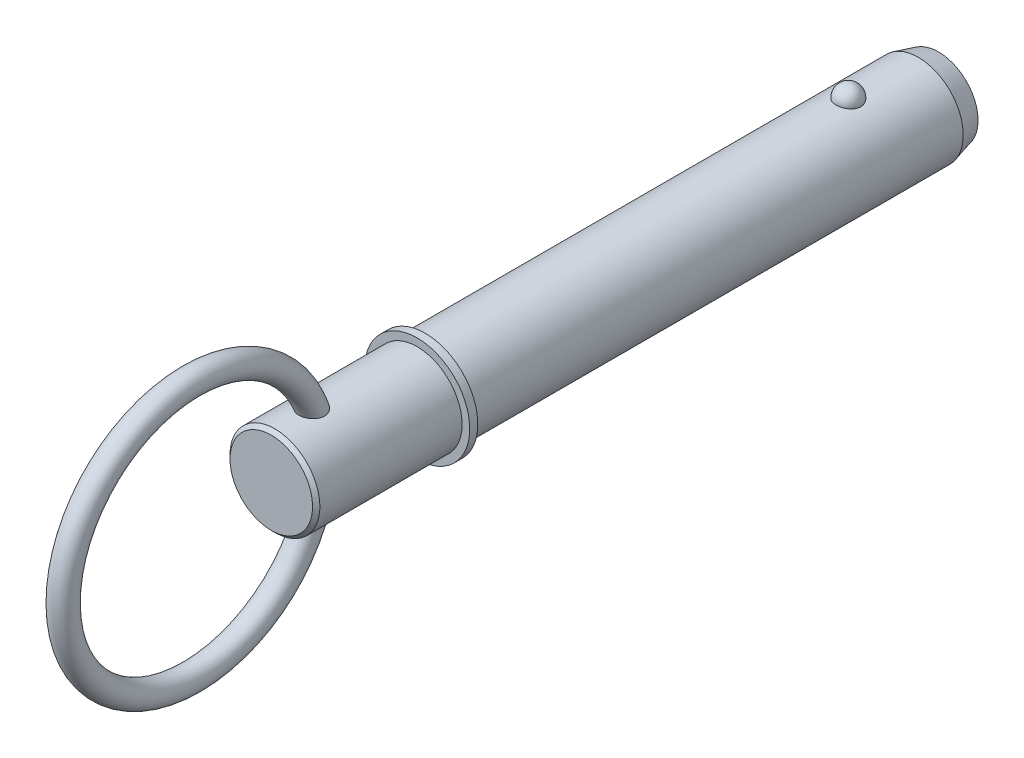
ISO-10303-21;
HEADER;
FILE_DESCRIPTION(('STEP AP214'),'2;1');
FILE_NAME('part.step','',(''),(''),'','','');
FILE_SCHEMA(('AUTOMOTIVE_DESIGN { 1 0 10303 214 1 1 1 1 }'));
ENDSEC;
DATA;
#1=APPLICATION_CONTEXT('core data for automotive mechanical design processes');
#2=APPLICATION_PROTOCOL_DEFINITION('international standard','automotive_design',2000,#1);
#3=PRODUCT_CONTEXT('',#1,'mechanical');
#4=PRODUCT('Part','Part','',(#3));
#5=PRODUCT_RELATED_PRODUCT_CATEGORY('part','',(#4));
#6=PRODUCT_DEFINITION_FORMATION('','',#4);
#7=PRODUCT_DEFINITION_CONTEXT('part definition',#1,'design');
#8=PRODUCT_DEFINITION('design','',#6,#7);
#9=PRODUCT_DEFINITION_SHAPE('','',#8);
#10=(LENGTH_UNIT() NAMED_UNIT(*) SI_UNIT(.MILLI.,.METRE.));
#11=(NAMED_UNIT(*) PLANE_ANGLE_UNIT() SI_UNIT($,.RADIAN.));
#12=(NAMED_UNIT(*) SI_UNIT($,.STERADIAN.) SOLID_ANGLE_UNIT());
#13=UNCERTAINTY_MEASURE_WITH_UNIT(LENGTH_MEASURE(1.E-05),#10,'distance_accuracy_value','');
#14=(GEOMETRIC_REPRESENTATION_CONTEXT(3) GLOBAL_UNCERTAINTY_ASSIGNED_CONTEXT((#13)) GLOBAL_UNIT_ASSIGNED_CONTEXT((#10,
#11,#12)) REPRESENTATION_CONTEXT('',''));
#15=CARTESIAN_POINT('',(0.,0.,0.));
#16=DIRECTION('',(0.,0.,1.));
#17=DIRECTION('',(1.,0.,0.));
#18=AXIS2_PLACEMENT_3D('',#15,#16,#17);
#19=CARTESIAN_POINT('',(0.,0.,101.6));
#20=DIRECTION('',(0.,0.,-1.));
#21=DIRECTION('',(-1.,0.,0.));
#22=AXIS2_PLACEMENT_3D('',#19,#20,#21);
#23=CYLINDRICAL_SURFACE('',#22,11.115);
#24=CARTESIAN_POINT('',(3.04058343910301,10.6910278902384,-3.07));
#25=CARTESIAN_POINT('',(3.04058039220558,10.6910304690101,-2.89837124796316));
#26=CARTESIAN_POINT('',(3.02657193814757,10.6950430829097,-2.72670368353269));
#27=CARTESIAN_POINT('',(2.97087341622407,10.7106465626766,-2.38822964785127));
#28=CARTESIAN_POINT('',(2.92917240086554,10.7222404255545,-2.22142512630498));
#29=CARTESIAN_POINT('',(2.81915317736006,10.751689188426,-1.89750816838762));
#30=CARTESIAN_POINT('',(2.75084669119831,10.7695413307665,-1.7403914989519));
#31=CARTESIAN_POINT('',(2.58932284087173,10.809510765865,-1.44013959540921));
#32=CARTESIAN_POINT('',(2.49610617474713,10.8316279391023,-1.29700396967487));
#33=CARTESIAN_POINT('',(2.28659317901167,10.877786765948,-1.02797591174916));
#34=CARTESIAN_POINT('',(2.17018825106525,10.9018371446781,-0.902169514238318));
#35=CARTESIAN_POINT('',(1.91759004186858,10.9490888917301,-0.672091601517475));
#36=CARTESIAN_POINT('',(1.78139672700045,10.9722902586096,-0.567820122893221));
#37=CARTESIAN_POINT('',(1.49327884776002,11.0151925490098,-0.383992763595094));
#38=CARTESIAN_POINT('',(1.34139928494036,11.034903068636,-0.30436866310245));
#39=CARTESIAN_POINT('',(1.02584823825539,11.0686948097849,-0.171731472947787));
#40=CARTESIAN_POINT('',(0.86217801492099,11.0827766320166,-0.118715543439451));
#41=CARTESIAN_POINT('',(0.530748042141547,11.1035404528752,-0.0415304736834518));
#42=CARTESIAN_POINT('',(0.363109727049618,11.1103474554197,-0.0168734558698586));
#43=CARTESIAN_POINT('',(0.0259327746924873,11.1162480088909,0.00453486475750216));
#44=CARTESIAN_POINT('',(-0.143605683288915,11.1153422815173,0.00128877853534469));
#45=CARTESIAN_POINT('',(-0.477280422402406,11.1059854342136,-0.0327676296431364));
#46=CARTESIAN_POINT('',(-0.641459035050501,11.0976393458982,-0.0631942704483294));
#47=CARTESIAN_POINT('',(-0.962236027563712,11.0744390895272,-0.150220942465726));
#48=CARTESIAN_POINT('',(-1.11883427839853,11.0595848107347,-0.20682141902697));
#49=CARTESIAN_POINT('',(-1.4210461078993,11.0248420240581,-0.345028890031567));
#50=CARTESIAN_POINT('',(-1.56659244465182,11.0049254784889,-0.426775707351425));
#51=CARTESIAN_POINT('',(-1.84189316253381,10.9622119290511,-0.612956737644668));
#52=CARTESIAN_POINT('',(-1.97164597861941,10.9394146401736,-0.71739319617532));
#53=CARTESIAN_POINT('',(-2.21432263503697,10.8929139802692,-0.948332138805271));
#54=CARTESIAN_POINT('',(-2.3268890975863,10.8692016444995,-1.07520847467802));
#55=CARTESIAN_POINT('',(-2.52940007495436,10.8238699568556,-1.34622145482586));
#56=CARTESIAN_POINT('',(-2.6193430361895,10.8022507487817,-1.49035928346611));
#57=CARTESIAN_POINT('',(-2.77523958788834,10.7632629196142,-1.79367507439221));
#58=CARTESIAN_POINT('',(-2.8409151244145,10.7459442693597,-1.95300253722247));
#59=CARTESIAN_POINT('',(-2.94519180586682,10.7178360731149,-2.28083009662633));
#60=CARTESIAN_POINT('',(-2.98379371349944,10.707046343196,-2.44932993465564));
#61=CARTESIAN_POINT('',(-3.03284665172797,10.6932559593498,-2.78998091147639));
#62=CARTESIAN_POINT('',(-3.04341313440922,10.6902233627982,-2.96211412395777));
#63=CARTESIAN_POINT('',(-3.03646037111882,10.6922002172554,-3.305762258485));
#64=CARTESIAN_POINT('',(-3.0189418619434,10.6972094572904,-3.47727719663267));
#65=CARTESIAN_POINT('',(-2.95641582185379,10.7146564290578,-3.81396465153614));
#66=CARTESIAN_POINT('',(-2.91154117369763,10.7270582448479,-3.97916375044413));
#67=CARTESIAN_POINT('',(-2.79553341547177,10.7578713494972,-4.29947360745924));
#68=CARTESIAN_POINT('',(-2.72439927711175,10.7762828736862,-4.45458397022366));
#69=CARTESIAN_POINT('',(-2.55718900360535,10.8171819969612,-4.75123550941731));
#70=CARTESIAN_POINT('',(-2.46098224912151,10.8396907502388,-4.89270014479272));
#71=CARTESIAN_POINT('',(-2.24623042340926,10.8862165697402,-5.15724095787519));
#72=CARTESIAN_POINT('',(-2.12768452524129,10.9102336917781,-5.28031645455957));
#73=CARTESIAN_POINT('',(-1.87085107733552,10.9571990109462,-5.5050961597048));
#74=CARTESIAN_POINT('',(-1.73249451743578,10.9801430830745,-5.60672245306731));
#75=CARTESIAN_POINT('',(-1.44010079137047,11.0223008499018,-5.78517789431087));
#76=CARTESIAN_POINT('',(-1.28606470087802,11.0415148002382,-5.86200874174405));
#77=CARTESIAN_POINT('',(-0.968615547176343,11.0738491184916,-5.98788441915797));
#78=CARTESIAN_POINT('',(-0.805339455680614,11.0870408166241,-6.03725610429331));
#79=CARTESIAN_POINT('',(-0.47244987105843,11.1062048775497,-6.10820004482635));
#80=CARTESIAN_POINT('',(-0.302837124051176,11.11217808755,-6.1297755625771));
#81=CARTESIAN_POINT('',(0.0345765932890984,11.1162034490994,-6.14436196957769));
#82=CARTESIAN_POINT('',(0.20235372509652,11.1143988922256,-6.13788957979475));
#83=CARTESIAN_POINT('',(0.534364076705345,11.103390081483,-6.09773981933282));
#84=CARTESIAN_POINT('',(0.698597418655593,11.094186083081,-6.06406338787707));
#85=CARTESIAN_POINT('',(1.01830314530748,11.0694136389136,-5.97063285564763));
#86=CARTESIAN_POINT('',(1.17380497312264,11.0538682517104,-5.91097318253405));
#87=CARTESIAN_POINT('',(1.472484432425,11.0180608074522,-5.76723645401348));
#88=CARTESIAN_POINT('',(1.6156613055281,10.9977984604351,-5.68315789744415));
#89=CARTESIAN_POINT('',(1.88801614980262,10.9543574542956,-5.49138807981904));
#90=CARTESIAN_POINT('',(2.01695079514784,10.9311394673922,-5.38336024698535));
#91=CARTESIAN_POINT('',(2.25501495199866,10.8845248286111,-5.14733839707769));
#92=CARTESIAN_POINT('',(2.36414099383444,10.8611281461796,-5.01934088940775));
#93=CARTESIAN_POINT('',(2.56152595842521,10.8162958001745,-4.74447932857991));
#94=CARTESIAN_POINT('',(2.64940088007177,10.7948999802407,-4.59733288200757));
#95=CARTESIAN_POINT('',(2.79961494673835,10.7569242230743,-4.29001203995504));
#96=CARTESIAN_POINT('',(2.86196390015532,10.7403424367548,-4.12984267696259));
#97=CARTESIAN_POINT('',(2.95377333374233,10.715429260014,-3.820623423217));
#98=CARTESIAN_POINT('',(2.98627018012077,10.7063495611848,-3.6725268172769));
#99=CARTESIAN_POINT('',(3.02967634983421,10.6941478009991,-3.37296350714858));
#100=CARTESIAN_POINT('',(3.04058612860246,10.6910256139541,-3.22149687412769));
#101=CARTESIAN_POINT('',(3.04058343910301,10.6910278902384,-3.07));
#102=B_SPLINE_CURVE_WITH_KNOTS('',3,(#24,#25,#26,#27,#28,#29,#30,#31,#32,#33,#34,#35,#36,#37,
#38,#39,#40,#41,#42,#43,#44,#45,#46,#47,#48,#49,#50,#51,#52,#53,#54,#55,#56,#57,#58,#59,#60,#61,
#62,#63,#64,#65,#66,#67,#68,#69,#70,#71,#72,#73,#74,#75,#76,#77,#78,#79,#80,#81,#82,#83,#84,#85,
#86,#87,#88,#89,#90,#91,#92,#93,#94,#95,#96,#97,#98,#99,#100,#101),.UNSPECIFIED.,.T.,.F.,(4,2,2,
2,2,2,2,2,2,2,2,2,2,2,2,2,2,2,2,2,2,2,2,2,2,2,2,2,2,2,2,2,2,2,2,2,2,2,4),(0.,0.514341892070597,
1.02888723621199,1.54320613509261,2.0575106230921,2.57428293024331,3.09105611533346,
3.60638589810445,4.1216606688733,4.62793159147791,5.1341551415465,5.63334381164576,
6.13254097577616,6.63456562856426,7.13663998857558,7.64804063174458,8.15947638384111,
8.6766026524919,9.19371435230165,9.70869321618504,10.223658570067,10.7361421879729,
11.2486458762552,11.7638748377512,12.2791228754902,12.7962115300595,13.3132647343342,
13.8240238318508,14.3347229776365,14.8360540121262,15.3373677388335,15.8368746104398,
16.3364121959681,16.8434736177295,17.3506237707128,17.8663484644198,18.3818748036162,
18.8358944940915,19.2899046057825),.UNSPECIFIED.);
#103=CARTESIAN_POINT('',(3.04058343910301,10.6910278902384,-3.07));
#104=VERTEX_POINT('',#103);
#105=EDGE_CURVE('E103',#104,#104,#102,.T.);
#106=ORIENTED_EDGE('',*,*,#105,.T.);
#107=EDGE_LOOP('',(#106));
#108=FACE_BOUND('',#107,.T.);
#109=CARTESIAN_POINT('',(0.,0.,-20.3999999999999));
#110=DIRECTION('',(0.,0.,-1.));
#111=DIRECTION('',(-1.,0.,0.));
#112=AXIS2_PLACEMENT_3D('',#109,#110,#111);
#113=CIRCLE('',#112,11.115);
#114=CARTESIAN_POINT('',(-11.115,0.,-20.3999999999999));
#115=VERTEX_POINT('',#114);
#116=EDGE_CURVE('E111',#115,#115,#113,.F.);
#117=ORIENTED_EDGE('',*,*,#116,.T.);
#118=EDGE_LOOP('',(#117));
#119=FACE_BOUND('',#118,.T.);
#120=CARTESIAN_POINT('',(0.,0.,101.6));
#121=DIRECTION('',(0.,0.,1.));
#122=DIRECTION('',(1.,0.,0.));
#123=AXIS2_PLACEMENT_3D('',#120,#121,#122);
#124=CIRCLE('',#123,11.115);
#125=CARTESIAN_POINT('',(11.115,0.,101.6));
#126=VERTEX_POINT('',#125);
#127=EDGE_CURVE('E109',#126,#126,#124,.T.);
#128=ORIENTED_EDGE('',*,*,#127,.F.);
#129=EDGE_LOOP('',(#128));
#130=FACE_BOUND('',#129,.T.);
#131=ADVANCED_FACE('F39',(#108,#119,#130),#23,.T.);
#132=CARTESIAN_POINT('',(0.,0.,-25.4));
#133=DIRECTION('',(0.,0.,-1.));
#134=DIRECTION('',(-1.,0.,0.));
#135=AXIS2_PLACEMENT_3D('',#132,#133,#134);
#136=PLANE('',#135);
#137=CARTESIAN_POINT('',(0.,0.,-25.4));
#138=DIRECTION('',(0.,0.,-1.));
#139=DIRECTION('',(-1.,0.,0.));
#140=AXIS2_PLACEMENT_3D('',#137,#138,#139);
#141=CIRCLE('',#140,9.77525403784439);
#142=CARTESIAN_POINT('',(-9.77525403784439,0.,-25.4));
#143=VERTEX_POINT('',#142);
#144=EDGE_CURVE('E143',#143,#143,#141,.T.);
#145=ORIENTED_EDGE('',*,*,#144,.T.);
#146=EDGE_LOOP('',(#145));
#147=FACE_BOUND('',#146,.T.);
#148=ADVANCED_FACE('F89',(#147),#136,.T.);
#149=CARTESIAN_POINT('',(0.,0.,-25.4));
#150=DIRECTION('',(0.,0.,1.));
#151=DIRECTION('',(1.,0.,0.));
#152=AXIS2_PLACEMENT_3D('',#149,#150,#151);
#153=CONICAL_SURFACE('',#152,9.77525403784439,0.261799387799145);
#154=ORIENTED_EDGE('',*,*,#116,.F.);
#155=EDGE_LOOP('',(#154));
#156=FACE_BOUND('',#155,.T.);
#157=ORIENTED_EDGE('',*,*,#144,.F.);
#158=EDGE_LOOP('',(#157));
#159=FACE_BOUND('',#158,.T.);
#160=ADVANCED_FACE('F95',(#156,#159),#153,.T.);
#161=CARTESIAN_POINT('',(0.,11.115,-3.07));
#162=DIRECTION('',(0.,1.,0.));
#163=DIRECTION('',(0.,0.,1.));
#164=AXIS2_PLACEMENT_3D('',#161,#162,#163);
#165=SPHERICAL_SURFACE('',#164,3.07);
#166=ORIENTED_EDGE('',*,*,#105,.F.);
#167=EDGE_LOOP('',(#166));
#168=FACE_BOUND('',#167,.T.);
#169=ADVANCED_FACE('F114',(#168),#165,.T.);
#170=CARTESIAN_POINT('',(0.,0.,101.6));
#171=DIRECTION('',(0.,0.,-1.));
#172=DIRECTION('',(-1.,0.,0.));
#173=AXIS2_PLACEMENT_3D('',#170,#171,#172);
#174=PLANE('',#173);
#175=ORIENTED_EDGE('',*,*,#127,.T.);
#176=EDGE_LOOP('',(#175));
#177=FACE_BOUND('',#176,.T.);
#178=CARTESIAN_POINT('',(0.,0.,101.6));
#179=DIRECTION('',(0.,0.,-1.));
#180=DIRECTION('',(-1.,0.,0.));
#181=AXIS2_PLACEMENT_3D('',#178,#179,#180);
#182=CIRCLE('',#181,13.);
#183=CARTESIAN_POINT('',(-13.,0.,101.6));
#184=VERTEX_POINT('',#183);
#185=EDGE_CURVE('E110',#184,#184,#182,.T.);
#186=ORIENTED_EDGE('',*,*,#185,.T.);
#187=EDGE_LOOP('',(#186));
#188=FACE_BOUND('',#187,.T.);
#189=ADVANCED_FACE('F118',(#177,#188),#174,.T.);
#190=CARTESIAN_POINT('',(0.,0.,33.7287874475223));
#191=DIRECTION('',(0.,0.,-1.));
#192=DIRECTION('',(-1.,0.,0.));
#193=AXIS2_PLACEMENT_3D('',#190,#191,#192);
#194=CYLINDRICAL_SURFACE('',#193,13.);
#195=CARTESIAN_POINT('',(0.,0.,103.6));
#196=DIRECTION('',(0.,0.,-1.));
#197=DIRECTION('',(-1.,0.,0.));
#198=AXIS2_PLACEMENT_3D('',#195,#196,#197);
#199=CIRCLE('',#198,13.);
#200=CARTESIAN_POINT('',(-13.,0.,103.6));
#201=VERTEX_POINT('',#200);
#202=EDGE_CURVE('E135',#201,#201,#199,.T.);
#203=ORIENTED_EDGE('',*,*,#202,.T.);
#204=EDGE_LOOP('',(#203));
#205=FACE_BOUND('',#204,.T.);
#206=ORIENTED_EDGE('',*,*,#185,.F.);
#207=EDGE_LOOP('',(#206));
#208=FACE_BOUND('',#207,.T.);
#209=ADVANCED_FACE('F122',(#205,#208),#194,.T.);
#210=CARTESIAN_POINT('',(0.,13.,103.6));
#211=DIRECTION('',(0.,0.,1.));
#212=DIRECTION('',(1.,0.,0.));
#213=AXIS2_PLACEMENT_3D('',#210,#211,#212);
#214=PLANE('',#213);
#215=CARTESIAN_POINT('',(0.,0.,103.6));
#216=DIRECTION('',(0.,0.,1.));
#217=DIRECTION('',(1.,0.,0.));
#218=AXIS2_PLACEMENT_3D('',#215,#216,#217);
#219=CIRCLE('',#218,11.115);
#220=CARTESIAN_POINT('',(11.115,0.,103.6));
#221=VERTEX_POINT('',#220);
#222=EDGE_CURVE('E113',#221,#221,#219,.T.);
#223=ORIENTED_EDGE('',*,*,#222,.F.);
#224=EDGE_LOOP('',(#223));
#225=FACE_BOUND('',#224,.T.);
#226=ORIENTED_EDGE('',*,*,#202,.F.);
#227=EDGE_LOOP('',(#226));
#228=FACE_BOUND('',#227,.T.);
#229=ADVANCED_FACE('F86',(#225,#228),#214,.T.);
#230=CARTESIAN_POINT('',(0.,0.,139.7));
#231=DIRECTION('',(0.,0.,-1.));
#232=DIRECTION('',(-1.,0.,0.));
#233=AXIS2_PLACEMENT_3D('',#230,#231,#232);
#234=CYLINDRICAL_SURFACE('',#233,11.115);
#235=CARTESIAN_POINT('',(-1.22435852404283,-11.0473603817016,126.778419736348));
#236=CARTESIAN_POINT('',(-1.07078016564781,-11.0643805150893,126.711699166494));
#237=CARTESIAN_POINT('',(-0.911372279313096,-11.0787777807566,126.657745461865));
#238=CARTESIAN_POINT('',(-0.585451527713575,-11.1007717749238,126.576552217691));
#239=CARTESIAN_POINT('',(-0.418938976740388,-11.1083688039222,126.549311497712));
#240=CARTESIAN_POINT('',(-0.0835394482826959,-11.1159515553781,126.522121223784));
#241=CARTESIAN_POINT('',(0.0853474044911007,-11.1159376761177,126.522170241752));
#242=CARTESIAN_POINT('',(0.420723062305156,-11.1083011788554,126.549554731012));
#243=CARTESIAN_POINT('',(0.587211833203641,-11.1006784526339,126.576890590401));
#244=CARTESIAN_POINT('',(0.913189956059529,-11.0786293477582,126.65829957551));
#245=CARTESIAN_POINT('',(1.07267378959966,-11.0641977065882,126.712393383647));
#246=CARTESIAN_POINT('',(1.37994044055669,-11.0300907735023,126.846140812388));
#247=CARTESIAN_POINT('',(1.52772335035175,-11.0104155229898,126.925794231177));
#248=CARTESIAN_POINT('',(1.80679367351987,-10.9680716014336,127.108467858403));
#249=CARTESIAN_POINT('',(1.93814041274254,-10.945414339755,127.211400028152));
#250=CARTESIAN_POINT('',(2.18117403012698,-10.8995884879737,127.438212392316));
#251=CARTESIAN_POINT('',(2.29286356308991,-10.8764199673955,127.562089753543));
#252=CARTESIAN_POINT('',(2.49238969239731,-10.8324319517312,127.825992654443));
#253=CARTESIAN_POINT('',(2.58046870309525,-10.8115899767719,127.965831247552));
#254=CARTESIAN_POINT('',(2.73218762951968,-10.7742522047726,128.258691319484));
#255=CARTESIAN_POINT('',(2.7958294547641,-10.757756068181,128.411711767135));
#256=CARTESIAN_POINT('',(2.89767977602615,-10.7307723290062,128.7266092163));
#257=CARTESIAN_POINT('',(2.93586554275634,-10.7202900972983,128.888493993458));
#258=CARTESIAN_POINT('',(2.98678800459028,-10.7062139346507,129.216480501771));
#259=CARTESIAN_POINT('',(2.99951894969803,-10.7026215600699,129.382583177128));
#260=CARTESIAN_POINT('',(3.0004780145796,-10.7023530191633,129.723227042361));
#261=CARTESIAN_POINT('',(2.98743421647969,-10.7060358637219,129.897770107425));
#262=CARTESIAN_POINT('',(2.93592917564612,-10.7202719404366,130.242750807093));
#263=CARTESIAN_POINT('',(2.8974582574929,-10.7308277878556,130.413186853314));
#264=CARTESIAN_POINT('',(2.79180512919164,-10.7588257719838,130.763114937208));
#265=CARTESIAN_POINT('',(2.72213928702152,-10.776850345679,130.941811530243));
#266=CARTESIAN_POINT('',(2.5561284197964,-10.8174264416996,131.285974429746));
#267=CARTESIAN_POINT('',(2.4597569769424,-10.8399824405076,131.451427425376));
#268=CARTESIAN_POINT('',(2.23434632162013,-10.8887625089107,131.775672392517));
#269=CARTESIAN_POINT('',(2.10349593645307,-10.9151327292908,131.933192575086));
#270=CARTESIAN_POINT('',(1.81505097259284,-10.96677510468,132.221668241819));
#271=CARTESIAN_POINT('',(1.65749731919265,-10.9920488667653,132.35266371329));
#272=CARTESIAN_POINT('',(1.36197799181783,-11.0319737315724,132.551313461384));
#273=CARTESIAN_POINT('',(1.22927684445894,-11.0476896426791,132.62660092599));
#274=CARTESIAN_POINT('',(0.952979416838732,-11.0749380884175,132.754574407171));
#275=CARTESIAN_POINT('',(0.809393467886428,-11.0864745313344,132.80728154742));
#276=CARTESIAN_POINT('',(0.513954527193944,-11.1041011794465,132.887058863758));
#277=CARTESIAN_POINT('',(0.362058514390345,-11.1101594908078,132.913978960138));
#278=CARTESIAN_POINT('',(0.0557792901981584,-11.1159132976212,132.939559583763));
#279=CARTESIAN_POINT('',(-0.0986030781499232,-11.1156109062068,132.938229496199));
#280=CARTESIAN_POINT('',(-0.389768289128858,-11.1090283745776,132.908935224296));
#281=CARTESIAN_POINT('',(-0.526830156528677,-11.1033186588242,132.883512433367));
#282=CARTESIAN_POINT('',(-0.794878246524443,-11.0873547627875,132.811270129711));
#283=CARTESIAN_POINT('',(-0.925863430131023,-11.0770998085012,132.764446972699));
#284=CARTESIAN_POINT('',(-1.18354406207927,-11.0525934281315,132.649843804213));
#285=CARTESIAN_POINT('',(-1.30991621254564,-11.0382116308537,132.581371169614));
#286=CARTESIAN_POINT('',(-1.55122352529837,-11.0068962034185,132.427131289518));
#287=CARTESIAN_POINT('',(-1.66615377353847,-10.9899614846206,132.341356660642));
#288=CARTESIAN_POINT('',(-1.90024050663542,-10.9520991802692,132.14087205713));
#289=CARTESIAN_POINT('',(-2.01728342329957,-10.9309598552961,132.023737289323));
#290=CARTESIAN_POINT('',(-2.23333659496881,-10.8888735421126,131.773839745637));
#291=CARTESIAN_POINT('',(-2.33233396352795,-10.8679267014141,131.641065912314));
#292=CARTESIAN_POINT('',(-2.52607041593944,-10.8246766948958,131.340000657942));
#293=CARTESIAN_POINT('',(-2.61741570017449,-10.8027194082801,131.169462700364));
#294=CARTESIAN_POINT('',(-2.77251687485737,-10.7639568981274,130.815671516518));
#295=CARTESIAN_POINT('',(-2.8362578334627,-10.7471544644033,130.632411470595));
#296=CARTESIAN_POINT('',(-2.93668505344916,-10.7201706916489,130.246624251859));
#297=CARTESIAN_POINT('',(-2.97161961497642,-10.7104219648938,130.043594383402));
#298=CARTESIAN_POINT('',(-2.99683495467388,-10.7033740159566,129.736874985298));
#299=CARTESIAN_POINT('',(-3.00070536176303,-10.7022882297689,129.634234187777));
#300=CARTESIAN_POINT('',(-2.99908594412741,-10.7027439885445,129.429049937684));
#301=CARTESIAN_POINT('',(-2.99360154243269,-10.7042840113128,129.326506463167));
#302=CARTESIAN_POINT('',(-2.97382504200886,-10.7097936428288,129.130330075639));
#303=CARTESIAN_POINT('',(-2.9602439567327,-10.7135669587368,129.036619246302));
#304=CARTESIAN_POINT('',(-2.92480741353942,-10.723295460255,128.850932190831));
#305=CARTESIAN_POINT('',(-2.90295619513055,-10.7292495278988,128.75895510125));
#306=CARTESIAN_POINT('',(-2.8509700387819,-10.7431800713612,128.577547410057));
#307=CARTESIAN_POINT('',(-2.82083748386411,-10.7511559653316,128.488116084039));
#308=CARTESIAN_POINT('',(-2.75241691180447,-10.7688750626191,128.31264532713));
#309=CARTESIAN_POINT('',(-2.71412954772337,-10.7786181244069,128.22660562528));
#310=CARTESIAN_POINT('',(-2.59550576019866,-10.807996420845,127.991055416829));
#311=CARTESIAN_POINT('',(-2.50612224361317,-10.8292837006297,127.846173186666));
#312=CARTESIAN_POINT('',(-2.30366035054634,-10.8741467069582,127.574571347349));
#313=CARTESIAN_POINT('',(-2.19058370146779,-10.8977222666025,127.447850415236));
#314=CARTESIAN_POINT('',(-1.94442412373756,-10.9443154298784,127.216462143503));
#315=CARTESIAN_POINT('',(-1.81141354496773,-10.967334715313,127.11171820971));
#316=CARTESIAN_POINT('',(-1.52904284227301,-11.0102504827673,126.926435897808));
#317=CARTESIAN_POINT('',(-1.37968206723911,-11.0301468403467,126.845898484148));
#318=CARTESIAN_POINT('',(-1.22435852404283,-11.0473603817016,126.778419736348));
#319=B_SPLINE_CURVE_WITH_KNOTS('',3,(#235,#236,#237,#238,#239,#240,#241,#242,#243,#244,#245,
#246,#247,#248,#249,#250,#251,#252,#253,#254,#255,#256,#257,#258,#259,#260,#261,#262,#263,#264,
#265,#266,#267,#268,#269,#270,#271,#272,#273,#274,#275,#276,#277,#278,#279,#280,#281,#282,#283,
#284,#285,#286,#287,#288,#289,#290,#291,#292,#293,#294,#295,#296,#297,#298,#299,#300,#301,#302,
#303,#304,#305,#306,#307,#308,#309,#310,#311,#312,#313,#314,#315,#316,#317,#318),.UNSPECIFIED.,
.T.,.F.,(4,2,2,2,2,2,2,2,2,2,2,2,2,2,2,2,2,2,2,2,2,2,2,2,2,2,2,2,2,2,2,2,2,2,2,2,2,2,2,2,2,4),
(0.,0.504317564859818,1.00861284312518,1.51288173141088,2.01715779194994,2.52182424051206,
3.02648670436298,3.52927157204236,4.03198848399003,4.5293269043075,5.02662645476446,
5.52436944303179,6.02222485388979,6.54526169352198,7.0684976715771,7.64398785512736,
8.22004937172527,8.83633461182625,9.45168373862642,9.90997173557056,10.3678300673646,
10.8283372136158,11.2886913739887,11.7053264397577,12.1220324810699,12.5537129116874,
12.9855779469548,13.4844842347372,13.9837454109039,14.565330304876,15.1472294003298,
15.762338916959,16.0701226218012,16.3777279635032,16.6616380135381,16.9454027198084,
17.229085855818,17.5127462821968,18.0246262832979,18.5364689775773,19.0464970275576,
19.5565453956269),.UNSPECIFIED.);
#320=CARTESIAN_POINT('',(-1.22435852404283,-11.0473603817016,126.778419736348));
#321=VERTEX_POINT('',#320);
#322=EDGE_CURVE('E10',#321,#321,#319,.T.);
#323=ORIENTED_EDGE('',*,*,#322,.F.);
#324=EDGE_LOOP('',(#323));
#325=FACE_BOUND('',#324,.T.);
#326=CARTESIAN_POINT('',(-1.22435852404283,11.0473603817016,126.778419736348));
#327=CARTESIAN_POINT('',(-1.37630771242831,11.0305212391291,126.844431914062));
#328=CARTESIAN_POINT('',(-1.52254325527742,11.0111158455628,126.922938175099));
#329=CARTESIAN_POINT('',(-1.79945383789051,10.9692671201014,127.10315338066));
#330=CARTESIAN_POINT('',(-1.93013010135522,10.9468240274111,127.204860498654));
#331=CARTESIAN_POINT('',(-2.17227655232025,10.9013603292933,127.429035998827));
#332=CARTESIAN_POINT('',(-2.2837375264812,10.8783394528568,127.551514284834));
#333=CARTESIAN_POINT('',(-2.48427458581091,10.8343057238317,127.813895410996));
#334=CARTESIAN_POINT('',(-2.57335330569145,10.8132926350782,127.953796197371));
#335=CARTESIAN_POINT('',(-2.7264007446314,10.7757209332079,128.245964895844));
#336=CARTESIAN_POINT('',(-2.79054231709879,10.7591319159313,128.39813851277));
#337=CARTESIAN_POINT('',(-2.89354234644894,10.7318913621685,128.711286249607));
#338=CARTESIAN_POINT('',(-2.93239912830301,10.7212402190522,128.872260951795));
#339=CARTESIAN_POINT('',(-2.9854043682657,10.7066038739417,129.201955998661));
#340=CARTESIAN_POINT('',(-2.9990165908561,10.7027634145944,129.370768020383));
#341=CARTESIAN_POINT('',(-3.00088147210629,10.7022388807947,129.708508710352));
#342=CARTESIAN_POINT('',(-2.98912652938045,10.7055569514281,129.877437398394));
#343=CARTESIAN_POINT('',(-2.93985175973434,10.7191979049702,130.224856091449));
#344=CARTESIAN_POINT('',(-2.90036626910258,10.7300544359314,130.403044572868));
#345=CARTESIAN_POINT('',(-2.79555002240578,10.7578360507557,130.751215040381));
#346=CARTESIAN_POINT('',(-2.73019988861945,10.774765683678,130.921190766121));
#347=CARTESIAN_POINT('',(-2.56762574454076,10.8147227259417,131.265784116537));
#348=CARTESIAN_POINT('',(-2.46786230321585,10.838191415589,131.439157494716));
#349=CARTESIAN_POINT('',(-2.24100420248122,10.8873575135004,131.766686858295));
#350=CARTESIAN_POINT('',(-2.11391925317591,10.9130541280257,131.920849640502));
#351=CARTESIAN_POINT('',(-1.85542700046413,10.9597063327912,132.182735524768));
#352=CARTESIAN_POINT('',(-1.727583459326,10.9807909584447,132.293955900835));
#353=CARTESIAN_POINT('',(-1.4548993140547,11.0202250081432,132.49412236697));
#354=CARTESIAN_POINT('',(-1.31006770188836,11.0385758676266,132.583080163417));
#355=CARTESIAN_POINT('',(-1.08171164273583,11.0625084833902,132.6963702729));
#356=CARTESIAN_POINT('',(-1.00332234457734,11.069914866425,132.730896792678));
#357=CARTESIAN_POINT('',(-0.84352596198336,11.0832350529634,132.792391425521));
#358=CARTESIAN_POINT('',(-0.762120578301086,11.0891496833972,132.819363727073));
#359=CARTESIAN_POINT('',(-0.597014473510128,11.0992628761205,132.86518193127));
#360=CARTESIAN_POINT('',(-0.513315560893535,11.1034627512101,132.884034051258));
#361=CARTESIAN_POINT('',(-0.344374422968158,11.1099851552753,132.913209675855));
#362=CARTESIAN_POINT('',(-0.259132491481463,11.1123080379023,132.923534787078));
#363=CARTESIAN_POINT('',(-0.100838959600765,11.114780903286,132.934519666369));
#364=CARTESIAN_POINT('',(-0.0278735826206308,11.1152042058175,132.936395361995));
#365=CARTESIAN_POINT('',(0.117962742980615,11.1146132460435,132.933773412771));
#366=CARTESIAN_POINT('',(0.1908336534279,11.1135985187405,132.929273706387));
#367=CARTESIAN_POINT('',(0.335842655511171,11.110161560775,132.913978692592));
#368=CARTESIAN_POINT('',(0.407981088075,11.1077400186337,132.903186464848));
#369=CARTESIAN_POINT('',(0.551029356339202,11.1015643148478,132.875503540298));
#370=CARTESIAN_POINT('',(0.621938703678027,11.0978096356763,132.858610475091));
#371=CARTESIAN_POINT('',(0.825381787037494,11.0851145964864,132.801054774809));
#372=CARTESIAN_POINT('',(0.955713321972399,11.0745538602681,132.752705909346));
#373=CARTESIAN_POINT('',(1.20733127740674,11.0499605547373,132.637325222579));
#374=CARTESIAN_POINT('',(1.32861527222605,11.0359270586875,132.570288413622));
#375=CARTESIAN_POINT('',(1.57344360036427,11.0038352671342,132.411843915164));
#376=CARTESIAN_POINT('',(1.695729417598,10.9855025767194,132.318551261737));
#377=CARTESIAN_POINT('',(1.92565215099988,10.9475431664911,132.115650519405));
#378=CARTESIAN_POINT('',(2.03328016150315,10.9279156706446,132.006032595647));
#379=CARTESIAN_POINT('',(2.2504891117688,10.8854412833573,131.75299112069));
#380=CARTESIAN_POINT('',(2.35710396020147,10.8626332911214,131.607010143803));
#381=CARTESIAN_POINT('',(2.54757318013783,10.8195493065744,131.300478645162));
#382=CARTESIAN_POINT('',(2.6314105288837,10.799275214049,131.139917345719));
#383=CARTESIAN_POINT('',(2.78342312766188,10.7611645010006,130.787827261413));
#384=CARTESIAN_POINT('',(2.84851472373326,10.7439117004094,130.594893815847));
#385=CARTESIAN_POINT('',(2.94562652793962,10.7177011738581,130.200130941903));
#386=CARTESIAN_POINT('',(2.97764942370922,10.7087427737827,129.99830223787));
#387=CARTESIAN_POINT('',(2.99864828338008,10.7028651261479,129.695989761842));
#388=CARTESIAN_POINT('',(3.00125529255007,10.7021342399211,129.596378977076));
#389=CARTESIAN_POINT('',(2.99763044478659,10.7031517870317,129.397345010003));
#390=CARTESIAN_POINT('',(2.99140295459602,10.704898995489,129.297921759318));
#391=CARTESIAN_POINT('',(2.9699008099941,10.710883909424,129.100179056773));
#392=CARTESIAN_POINT('',(2.95463019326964,10.7151205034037,129.001859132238));
#393=CARTESIAN_POINT('',(2.91493260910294,10.7259879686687,128.807219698));
#394=CARTESIAN_POINT('',(2.89050674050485,10.7326185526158,128.710899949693));
#395=CARTESIAN_POINT('',(2.83556656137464,10.7472556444,128.531222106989));
#396=CARTESIAN_POINT('',(2.80596337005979,10.7550439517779,128.447566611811));
#397=CARTESIAN_POINT('',(2.73953102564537,10.7721572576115,128.283300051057));
#398=CARTESIAN_POINT('',(2.70269935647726,10.7814827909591,128.202690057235));
#399=CARTESIAN_POINT('',(2.62203440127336,10.8013833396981,128.045273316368));
#400=CARTESIAN_POINT('',(2.57820565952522,10.8119575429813,127.968464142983));
#401=CARTESIAN_POINT('',(2.48382482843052,10.8340293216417,127.819223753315));
#402=CARTESIAN_POINT('',(2.43327032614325,10.8455272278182,127.746794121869));
#403=CARTESIAN_POINT('',(2.27895739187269,10.879345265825,127.545992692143));
#404=CARTESIAN_POINT('',(2.16717186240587,10.9023791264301,127.423764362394));
#405=CARTESIAN_POINT('',(1.92442677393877,10.9478318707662,127.200151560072));
#406=CARTESIAN_POINT('',(1.79346836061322,10.9702507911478,127.098765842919));
#407=CARTESIAN_POINT('',(1.51657151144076,11.0119360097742,126.919564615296));
#408=CARTESIAN_POINT('',(1.37069187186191,11.0312139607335,126.841661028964));
#409=CARTESIAN_POINT('',(1.06764402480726,11.0646548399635,126.710680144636));
#410=CARTESIAN_POINT('',(0.910475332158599,11.0788175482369,126.657603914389));
#411=CARTESIAN_POINT('',(0.587492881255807,11.1006548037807,126.57697871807));
#412=CARTESIAN_POINT('',(0.421604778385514,11.1082585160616,126.549708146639));
#413=CARTESIAN_POINT('',(0.0874262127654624,11.1159127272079,126.522259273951));
#414=CARTESIAN_POINT('',(-0.0808643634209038,11.1159628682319,126.52208225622));
#415=CARTESIAN_POINT('',(-0.416252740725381,11.1084780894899,126.548918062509));
#416=CARTESIAN_POINT('',(-0.583334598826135,11.1008914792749,126.576116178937));
#417=CARTESIAN_POINT('',(-0.910355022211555,11.0788693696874,126.657401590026));
#418=CARTESIAN_POINT('',(-1.07029370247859,11.064433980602,126.711488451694));
#419=CARTESIAN_POINT('',(-1.22435852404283,11.0473603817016,126.778419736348));
#420=B_SPLINE_CURVE_WITH_KNOTS('',3,(#326,#327,#328,#329,#330,#331,#332,#333,#334,#335,#336,
#337,#338,#339,#340,#341,#342,#343,#344,#345,#346,#347,#348,#349,#350,#351,#352,#353,#354,#355,
#356,#357,#358,#359,#360,#361,#362,#363,#364,#365,#366,#367,#368,#369,#370,#371,#372,#373,#374,
#375,#376,#377,#378,#379,#380,#381,#382,#383,#384,#385,#386,#387,#388,#389,#390,#391,#392,#393,
#394,#395,#396,#397,#398,#399,#400,#401,#402,#403,#404,#405,#406,#407,#408,#409,#410,#411,#412,
#413,#414,#415,#416,#417,#418,#419),.UNSPECIFIED.,.T.,.F.,(4,2,2,2,2,2,2,2,2,2,2,2,2,2,2,2,2,2,
2,2,2,2,2,2,2,2,2,2,2,2,2,2,2,2,2,2,2,2,2,2,2,2,2,2,2,2,4),(0.,0.498977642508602,
0.997916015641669,1.4970929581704,1.99621111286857,2.49180514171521,2.98743199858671,
3.4934712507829,3.99966216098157,4.54591839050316,5.09258465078,5.69407889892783,
6.29535972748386,6.80565832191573,7.31568801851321,7.57328514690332,7.83073916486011,
8.08799570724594,8.3452037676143,8.56389164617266,8.78265025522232,9.0013018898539,
9.22003849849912,9.63638938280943,10.0528514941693,10.5157946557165,10.9790178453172,
11.5234572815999,12.068302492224,12.6784825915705,13.2886130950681,13.5872082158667,
13.8856557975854,14.1839702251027,14.4822488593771,14.7491407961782,15.016125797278,
15.282938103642,15.5498463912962,16.0489312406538,16.5479862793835,17.0451454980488,
17.542326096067,18.0448111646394,18.5473200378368,19.0532532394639,19.5591782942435),.UNSPECIFIED.);
#421=CARTESIAN_POINT('',(-1.22435852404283,11.0473603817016,126.778419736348));
#422=VERTEX_POINT('',#421);
#423=EDGE_CURVE('E51',#422,#422,#420,.T.);
#424=ORIENTED_EDGE('',*,*,#423,.F.);
#425=EDGE_LOOP('',(#424));
#426=FACE_BOUND('',#425,.T.);
#427=CARTESIAN_POINT('',(0.,0.,138.8));
#428=DIRECTION('',(0.,0.,-1.));
#429=DIRECTION('',(-1.,0.,0.));
#430=AXIS2_PLACEMENT_3D('',#427,#428,#429);
#431=CIRCLE('',#430,11.115);
#432=CARTESIAN_POINT('',(-11.115,0.,138.8));
#433=VERTEX_POINT('',#432);
#434=EDGE_CURVE('E65',#433,#433,#431,.T.);
#435=ORIENTED_EDGE('',*,*,#434,.T.);
#436=EDGE_LOOP('',(#435));
#437=FACE_BOUND('',#436,.T.);
#438=ORIENTED_EDGE('',*,*,#222,.T.);
#439=EDGE_LOOP('',(#438));
#440=FACE_BOUND('',#439,.T.);
#441=ADVANCED_FACE('F70',(#325,#426,#437,#440),#234,.T.);
#442=CARTESIAN_POINT('',(0.,0.,139.7));
#443=DIRECTION('',(0.,0.,-1.));
#444=DIRECTION('',(-1.,0.,0.));
#445=AXIS2_PLACEMENT_3D('',#442,#443,#444);
#446=PLANE('',#445);
#447=CARTESIAN_POINT('',(0.,0.,139.7));
#448=DIRECTION('',(0.,0.,-1.));
#449=DIRECTION('',(-1.,0.,0.));
#450=AXIS2_PLACEMENT_3D('',#447,#448,#449);
#451=CIRCLE('',#450,10.2149999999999);
#452=CARTESIAN_POINT('',(-10.2149999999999,0.,139.7));
#453=VERTEX_POINT('',#452);
#454=EDGE_CURVE('E58',#453,#453,#451,.F.);
#455=ORIENTED_EDGE('',*,*,#454,.T.);
#456=EDGE_LOOP('',(#455));
#457=FACE_BOUND('',#456,.T.);
#458=ADVANCED_FACE('F77',(#457),#446,.F.);
#459=CARTESIAN_POINT('',(0.,0.,138.8));
#460=DIRECTION('',(0.,0.,-1.));
#461=DIRECTION('',(-1.,0.,0.));
#462=AXIS2_PLACEMENT_3D('',#459,#460,#461);
#463=CONICAL_SURFACE('',#462,11.115,0.785398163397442);
#464=ORIENTED_EDGE('',*,*,#454,.F.);
#465=EDGE_LOOP('',(#464));
#466=FACE_BOUND('',#465,.T.);
#467=ORIENTED_EDGE('',*,*,#434,.F.);
#468=EDGE_LOOP('',(#467));
#469=FACE_BOUND('',#468,.T.);
#470=ADVANCED_FACE('F41',(#466,#469),#463,.T.);
#471=CARTESIAN_POINT('',(0.,0.,159.45));
#472=DIRECTION('',(1.,0.,0.));
#473=DIRECTION('',(0.,0.,-1.));
#474=AXIS2_PLACEMENT_3D('',#471,#472,#473);
#475=TOROIDAL_SURFACE('',#474,31.75,3.);
#476=ORIENTED_EDGE('',*,*,#322,.T.);
#477=EDGE_LOOP('',(#476));
#478=FACE_BOUND('',#477,.T.);
#479=ORIENTED_EDGE('',*,*,#423,.T.);
#480=EDGE_LOOP('',(#479));
#481=FACE_BOUND('',#480,.T.);
#482=ADVANCED_FACE('F74',(#478,#481),#475,.T.);
#483=CLOSED_SHELL('',(#131,#148,#160,#169,#189,#209,#229,#441,#458,#470,#482));
#484=MANIFOLD_SOLID_BREP('B2',#483);
#485=ADVANCED_BREP_SHAPE_REPRESENTATION('',(#18,#484),#14);
#486=SHAPE_DEFINITION_REPRESENTATION(#9,#485);
ENDSEC;
END-ISO-10303-21;
